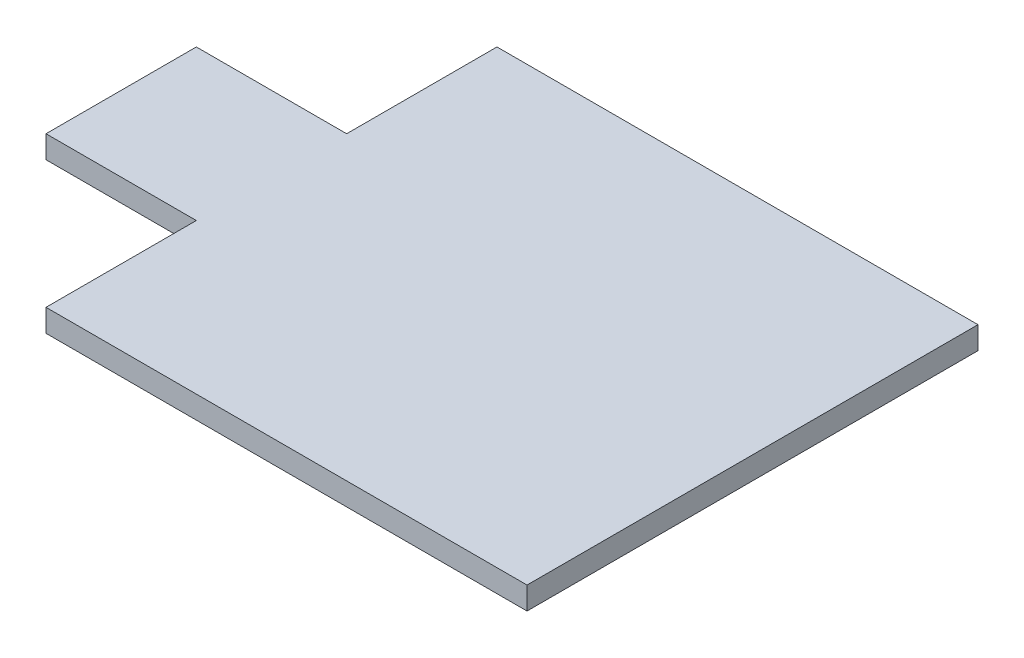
ISO-10303-21;
HEADER;
FILE_DESCRIPTION(('STEP AP214'),'2;1');
FILE_NAME('part.step','',(''),(''),'','','');
FILE_SCHEMA(('AUTOMOTIVE_DESIGN { 1 0 10303 214 1 1 1 1 }'));
ENDSEC;
DATA;
#1=APPLICATION_CONTEXT('core data for automotive mechanical design processes');
#2=APPLICATION_PROTOCOL_DEFINITION('international standard','automotive_design',2000,#1);
#3=PRODUCT_CONTEXT('',#1,'mechanical');
#4=PRODUCT('Part','Part','',(#3));
#5=PRODUCT_RELATED_PRODUCT_CATEGORY('part','',(#4));
#6=PRODUCT_DEFINITION_FORMATION('','',#4);
#7=PRODUCT_DEFINITION_CONTEXT('part definition',#1,'design');
#8=PRODUCT_DEFINITION('design','',#6,#7);
#9=PRODUCT_DEFINITION_SHAPE('','',#8);
#10=(LENGTH_UNIT() NAMED_UNIT(*) SI_UNIT(.MILLI.,.METRE.));
#11=(NAMED_UNIT(*) PLANE_ANGLE_UNIT() SI_UNIT($,.RADIAN.));
#12=(NAMED_UNIT(*) SI_UNIT($,.STERADIAN.) SOLID_ANGLE_UNIT());
#13=UNCERTAINTY_MEASURE_WITH_UNIT(LENGTH_MEASURE(1.E-05),#10,'distance_accuracy_value','');
#14=(GEOMETRIC_REPRESENTATION_CONTEXT(3) GLOBAL_UNCERTAINTY_ASSIGNED_CONTEXT((#13)) GLOBAL_UNIT_ASSIGNED_CONTEXT((#10,
#11,#12)) REPRESENTATION_CONTEXT('',''));
#15=CARTESIAN_POINT('',(0.,0.,0.));
#16=DIRECTION('',(0.,0.,1.));
#17=DIRECTION('',(1.,0.,0.));
#18=AXIS2_PLACEMENT_3D('',#15,#16,#17);
#19=CARTESIAN_POINT('',(31.5,-0.01,-5.));
#20=DIRECTION('',(0.,0.,-1.));
#21=DIRECTION('',(-1.,0.,0.));
#22=AXIS2_PLACEMENT_3D('',#19,#20,#21);
#23=PLANE('',#22);
#24=DIRECTION('',(0.,1.,0.));
#25=VECTOR('',#24,1.);
#26=CARTESIAN_POINT('',(41.5,-0.01,-5.));
#27=LINE('',#26,#25);
#28=CARTESIAN_POINT('',(41.5,0.,-5.));
#29=VERTEX_POINT('',#28);
#30=CARTESIAN_POINT('',(41.5,1.5,-5.));
#31=VERTEX_POINT('',#30);
#32=EDGE_CURVE('E11',#29,#31,#27,.T.);
#33=ORIENTED_EDGE('',*,*,#32,.F.);
#34=DIRECTION('',(-1.,0.,0.));
#35=VECTOR('',#34,1.);
#36=CARTESIAN_POINT('',(0.,0.,-4.99999999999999));
#37=LINE('',#36,#35);
#38=CARTESIAN_POINT('',(31.5,0.,-5.));
#39=VERTEX_POINT('',#38);
#40=EDGE_CURVE('E123',#29,#39,#37,.T.);
#41=ORIENTED_EDGE('',*,*,#40,.T.);
#42=DIRECTION('',(0.,1.,0.));
#43=VECTOR('',#42,1.);
#44=CARTESIAN_POINT('',(31.5,-0.01,-5.));
#45=LINE('',#44,#43);
#46=CARTESIAN_POINT('',(31.5,1.5,-5.));
#47=VERTEX_POINT('',#46);
#48=EDGE_CURVE('E139',#39,#47,#45,.T.);
#49=ORIENTED_EDGE('',*,*,#48,.T.);
#50=DIRECTION('',(-1.,0.,0.));
#51=VECTOR('',#50,1.);
#52=CARTESIAN_POINT('',(0.,1.5,-4.99999999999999));
#53=LINE('',#52,#51);
#54=EDGE_CURVE('E135',#31,#47,#53,.T.);
#55=ORIENTED_EDGE('',*,*,#54,.F.);
#56=EDGE_LOOP('',(#33,#41,#49,#55));
#57=FACE_BOUND('',#56,.T.);
#58=ADVANCED_FACE('F35',(#57),#23,.T.);
#59=CARTESIAN_POINT('',(41.5,-0.01,-15.));
#60=DIRECTION('',(-1.,0.,0.));
#61=DIRECTION('',(0.,0.,1.));
#62=AXIS2_PLACEMENT_3D('',#59,#60,#61);
#63=PLANE('',#62);
#64=DIRECTION('',(0.,1.,0.));
#65=VECTOR('',#64,1.);
#66=CARTESIAN_POINT('',(41.5,1.5,-15.));
#67=LINE('',#66,#65);
#68=CARTESIAN_POINT('',(41.5,0.,-15.));
#69=VERTEX_POINT('',#68);
#70=CARTESIAN_POINT('',(41.5,1.5,-15.));
#71=VERTEX_POINT('',#70);
#72=EDGE_CURVE('E119',#69,#71,#67,.T.);
#73=ORIENTED_EDGE('',*,*,#72,.F.);
#74=DIRECTION('',(0.,0.,1.));
#75=VECTOR('',#74,1.);
#76=CARTESIAN_POINT('',(41.5,0.,0.));
#77=LINE('',#76,#75);
#78=EDGE_CURVE('E127',#69,#29,#77,.T.);
#79=ORIENTED_EDGE('',*,*,#78,.T.);
#80=ORIENTED_EDGE('',*,*,#32,.T.);
#81=DIRECTION('',(0.,0.,1.));
#82=VECTOR('',#81,1.);
#83=CARTESIAN_POINT('',(41.5,1.5,0.));
#84=LINE('',#83,#82);
#85=EDGE_CURVE('E165',#71,#31,#84,.T.);
#86=ORIENTED_EDGE('',*,*,#85,.F.);
#87=EDGE_LOOP('',(#73,#79,#80,#86));
#88=FACE_BOUND('',#87,.T.);
#89=ADVANCED_FACE('F175',(#88),#63,.T.);
#90=CARTESIAN_POINT('',(41.5,-0.01,15.));
#91=DIRECTION('',(-1.,0.,0.));
#92=DIRECTION('',(0.,0.,1.));
#93=AXIS2_PLACEMENT_3D('',#90,#91,#92);
#94=PLANE('',#93);
#95=DIRECTION('',(0.,1.,0.));
#96=VECTOR('',#95,1.);
#97=CARTESIAN_POINT('',(41.5,-0.01,5.));
#98=LINE('',#97,#96);
#99=CARTESIAN_POINT('',(41.5,0.,5.));
#100=VERTEX_POINT('',#99);
#101=CARTESIAN_POINT('',(41.5,1.5,5.));
#102=VERTEX_POINT('',#101);
#103=EDGE_CURVE('E39',#100,#102,#98,.T.);
#104=ORIENTED_EDGE('',*,*,#103,.F.);
#105=DIRECTION('',(0.,0.,1.));
#106=VECTOR('',#105,1.);
#107=CARTESIAN_POINT('',(41.5,0.,0.));
#108=LINE('',#107,#106);
#109=CARTESIAN_POINT('',(41.5,0.,15.));
#110=VERTEX_POINT('',#109);
#111=EDGE_CURVE('E109',#100,#110,#108,.T.);
#112=ORIENTED_EDGE('',*,*,#111,.T.);
#113=DIRECTION('',(0.,1.,0.));
#114=VECTOR('',#113,1.);
#115=CARTESIAN_POINT('',(41.5,1.5,15.));
#116=LINE('',#115,#114);
#117=CARTESIAN_POINT('',(41.5,1.5,15.));
#118=VERTEX_POINT('',#117);
#119=EDGE_CURVE('E116',#110,#118,#116,.T.);
#120=ORIENTED_EDGE('',*,*,#119,.T.);
#121=DIRECTION('',(0.,0.,1.));
#122=VECTOR('',#121,1.);
#123=CARTESIAN_POINT('',(41.5,1.5,0.));
#124=LINE('',#123,#122);
#125=EDGE_CURVE('E132',#102,#118,#124,.T.);
#126=ORIENTED_EDGE('',*,*,#125,.F.);
#127=EDGE_LOOP('',(#104,#112,#120,#126));
#128=FACE_BOUND('',#127,.T.);
#129=ADVANCED_FACE('F122',(#128),#94,.T.);
#130=CARTESIAN_POINT('',(31.5,-0.01,5.));
#131=DIRECTION('',(0.,0.,1.));
#132=DIRECTION('',(1.,0.,0.));
#133=AXIS2_PLACEMENT_3D('',#130,#131,#132);
#134=PLANE('',#133);
#135=DIRECTION('',(0.,-1.,0.));
#136=VECTOR('',#135,1.);
#137=CARTESIAN_POINT('',(31.5,-0.01,5.));
#138=LINE('',#137,#136);
#139=CARTESIAN_POINT('',(31.5,1.5,5.));
#140=VERTEX_POINT('',#139);
#141=CARTESIAN_POINT('',(31.5,0.,5.));
#142=VERTEX_POINT('',#141);
#143=EDGE_CURVE('E112',#140,#142,#138,.T.);
#144=ORIENTED_EDGE('',*,*,#143,.T.);
#145=DIRECTION('',(1.,0.,0.));
#146=VECTOR('',#145,1.);
#147=CARTESIAN_POINT('',(0.,0.,5.));
#148=LINE('',#147,#146);
#149=EDGE_CURVE('E124',#142,#100,#148,.T.);
#150=ORIENTED_EDGE('',*,*,#149,.T.);
#151=ORIENTED_EDGE('',*,*,#103,.T.);
#152=DIRECTION('',(1.,0.,0.));
#153=VECTOR('',#152,1.);
#154=CARTESIAN_POINT('',(0.,1.5,5.));
#155=LINE('',#154,#153);
#156=EDGE_CURVE('E134',#140,#102,#155,.T.);
#157=ORIENTED_EDGE('',*,*,#156,.F.);
#158=EDGE_LOOP('',(#144,#150,#151,#157));
#159=FACE_BOUND('',#158,.T.);
#160=ADVANCED_FACE('F191',(#159),#134,.T.);
#161=CARTESIAN_POINT('',(31.5,-0.01,-5.));
#162=DIRECTION('',(-1.,0.,0.));
#163=DIRECTION('',(0.,0.,1.));
#164=AXIS2_PLACEMENT_3D('',#161,#162,#163);
#165=PLANE('',#164);
#166=ORIENTED_EDGE('',*,*,#48,.F.);
#167=DIRECTION('',(0.,0.,1.));
#168=VECTOR('',#167,1.);
#169=CARTESIAN_POINT('',(31.5,0.,0.));
#170=LINE('',#169,#168);
#171=EDGE_CURVE('E120',#39,#142,#170,.T.);
#172=ORIENTED_EDGE('',*,*,#171,.T.);
#173=ORIENTED_EDGE('',*,*,#143,.F.);
#174=DIRECTION('',(0.,0.,1.));
#175=VECTOR('',#174,1.);
#176=CARTESIAN_POINT('',(31.5,1.5,0.));
#177=LINE('',#176,#175);
#178=EDGE_CURVE('E163',#47,#140,#177,.T.);
#179=ORIENTED_EDGE('',*,*,#178,.F.);
#180=EDGE_LOOP('',(#166,#172,#173,#179));
#181=FACE_BOUND('',#180,.T.);
#182=ADVANCED_FACE('F186',(#181),#165,.T.);
#183=CARTESIAN_POINT('',(0.,1.5,15.));
#184=DIRECTION('',(0.,0.,-1.));
#185=DIRECTION('',(-1.,0.,0.));
#186=AXIS2_PLACEMENT_3D('',#183,#184,#185);
#187=PLANE('',#186);
#188=ORIENTED_EDGE('',*,*,#119,.F.);
#189=DIRECTION('',(1.,0.,0.));
#190=VECTOR('',#189,1.);
#191=CARTESIAN_POINT('',(0.,0.,15.));
#192=LINE('',#191,#190);
#193=CARTESIAN_POINT('',(73.5,0.,15.));
#194=VERTEX_POINT('',#193);
#195=EDGE_CURVE('E53',#110,#194,#192,.T.);
#196=ORIENTED_EDGE('',*,*,#195,.T.);
#197=DIRECTION('',(0.,-1.,0.));
#198=VECTOR('',#197,1.);
#199=CARTESIAN_POINT('',(73.5,1.5,15.));
#200=LINE('',#199,#198);
#201=CARTESIAN_POINT('',(73.5,1.5,15.));
#202=VERTEX_POINT('',#201);
#203=EDGE_CURVE('E137',#202,#194,#200,.T.);
#204=ORIENTED_EDGE('',*,*,#203,.F.);
#205=DIRECTION('',(1.,0.,0.));
#206=VECTOR('',#205,1.);
#207=CARTESIAN_POINT('',(0.,1.5,15.));
#208=LINE('',#207,#206);
#209=EDGE_CURVE('E118',#118,#202,#208,.T.);
#210=ORIENTED_EDGE('',*,*,#209,.F.);
#211=EDGE_LOOP('',(#188,#196,#204,#210));
#212=FACE_BOUND('',#211,.T.);
#213=ADVANCED_FACE('F117',(#212),#187,.F.);
#214=CARTESIAN_POINT('',(73.5,1.5,0.));
#215=DIRECTION('',(1.,0.,0.));
#216=DIRECTION('',(0.,0.,-1.));
#217=AXIS2_PLACEMENT_3D('',#214,#215,#216);
#218=PLANE('',#217);
#219=DIRECTION('',(0.,0.,1.));
#220=VECTOR('',#219,1.);
#221=CARTESIAN_POINT('',(73.5,0.,0.));
#222=LINE('',#221,#220);
#223=CARTESIAN_POINT('',(73.5,0.,-15.));
#224=VERTEX_POINT('',#223);
#225=EDGE_CURVE('E111',#224,#194,#222,.T.);
#226=ORIENTED_EDGE('',*,*,#225,.F.);
#227=DIRECTION('',(0.,-1.,0.));
#228=VECTOR('',#227,1.);
#229=CARTESIAN_POINT('',(73.5,1.5,-15.));
#230=LINE('',#229,#228);
#231=CARTESIAN_POINT('',(73.5,1.5,-15.));
#232=VERTEX_POINT('',#231);
#233=EDGE_CURVE('E154',#232,#224,#230,.T.);
#234=ORIENTED_EDGE('',*,*,#233,.F.);
#235=DIRECTION('',(0.,0.,1.));
#236=VECTOR('',#235,1.);
#237=CARTESIAN_POINT('',(73.5,1.5,0.));
#238=LINE('',#237,#236);
#239=EDGE_CURVE('E153',#232,#202,#238,.T.);
#240=ORIENTED_EDGE('',*,*,#239,.T.);
#241=ORIENTED_EDGE('',*,*,#203,.T.);
#242=EDGE_LOOP('',(#226,#234,#240,#241));
#243=FACE_BOUND('',#242,.T.);
#244=ADVANCED_FACE('F177',(#243),#218,.T.);
#245=CARTESIAN_POINT('',(0.,1.5,-15.));
#246=DIRECTION('',(0.,0.,-1.));
#247=DIRECTION('',(-1.,0.,0.));
#248=AXIS2_PLACEMENT_3D('',#245,#246,#247);
#249=PLANE('',#248);
#250=DIRECTION('',(1.,0.,0.));
#251=VECTOR('',#250,1.);
#252=CARTESIAN_POINT('',(0.,0.,-15.));
#253=LINE('',#252,#251);
#254=EDGE_CURVE('E151',#69,#224,#253,.T.);
#255=ORIENTED_EDGE('',*,*,#254,.F.);
#256=ORIENTED_EDGE('',*,*,#72,.T.);
#257=DIRECTION('',(1.,0.,0.));
#258=VECTOR('',#257,1.);
#259=CARTESIAN_POINT('',(0.,1.5,-15.));
#260=LINE('',#259,#258);
#261=EDGE_CURVE('E65',#71,#232,#260,.T.);
#262=ORIENTED_EDGE('',*,*,#261,.T.);
#263=ORIENTED_EDGE('',*,*,#233,.T.);
#264=EDGE_LOOP('',(#255,#256,#262,#263));
#265=FACE_BOUND('',#264,.T.);
#266=ADVANCED_FACE('F176',(#265),#249,.T.);
#267=CARTESIAN_POINT('',(0.,0.,0.));
#268=DIRECTION('',(0.,1.,0.));
#269=DIRECTION('',(0.,0.,1.));
#270=AXIS2_PLACEMENT_3D('',#267,#268,#269);
#271=PLANE('',#270);
#272=ORIENTED_EDGE('',*,*,#171,.F.);
#273=ORIENTED_EDGE('',*,*,#40,.F.);
#274=ORIENTED_EDGE('',*,*,#78,.F.);
#275=ORIENTED_EDGE('',*,*,#254,.T.);
#276=ORIENTED_EDGE('',*,*,#225,.T.);
#277=ORIENTED_EDGE('',*,*,#195,.F.);
#278=ORIENTED_EDGE('',*,*,#111,.F.);
#279=ORIENTED_EDGE('',*,*,#149,.F.);
#280=EDGE_LOOP('',(#272,#273,#274,#275,#276,#277,#278,#279));
#281=FACE_BOUND('',#280,.T.);
#282=ADVANCED_FACE('F107',(#281),#271,.F.);
#283=CARTESIAN_POINT('',(0.,1.5,0.));
#284=DIRECTION('',(0.,1.,0.));
#285=DIRECTION('',(0.,0.,1.));
#286=AXIS2_PLACEMENT_3D('',#283,#284,#285);
#287=PLANE('',#286);
#288=ORIENTED_EDGE('',*,*,#54,.T.);
#289=ORIENTED_EDGE('',*,*,#178,.T.);
#290=ORIENTED_EDGE('',*,*,#156,.T.);
#291=ORIENTED_EDGE('',*,*,#125,.T.);
#292=ORIENTED_EDGE('',*,*,#209,.T.);
#293=ORIENTED_EDGE('',*,*,#239,.F.);
#294=ORIENTED_EDGE('',*,*,#261,.F.);
#295=ORIENTED_EDGE('',*,*,#85,.T.);
#296=EDGE_LOOP('',(#288,#289,#290,#291,#292,#293,#294,#295));
#297=FACE_BOUND('',#296,.T.);
#298=ADVANCED_FACE('F37',(#297),#287,.T.);
#299=CLOSED_SHELL('',(#58,#89,#129,#160,#182,#213,#244,#266,#282,#298));
#300=MANIFOLD_SOLID_BREP('B2',#299);
#301=ADVANCED_BREP_SHAPE_REPRESENTATION('',(#18,#300),#14);
#302=SHAPE_DEFINITION_REPRESENTATION(#9,#301);
ENDSEC;
END-ISO-10303-21;
